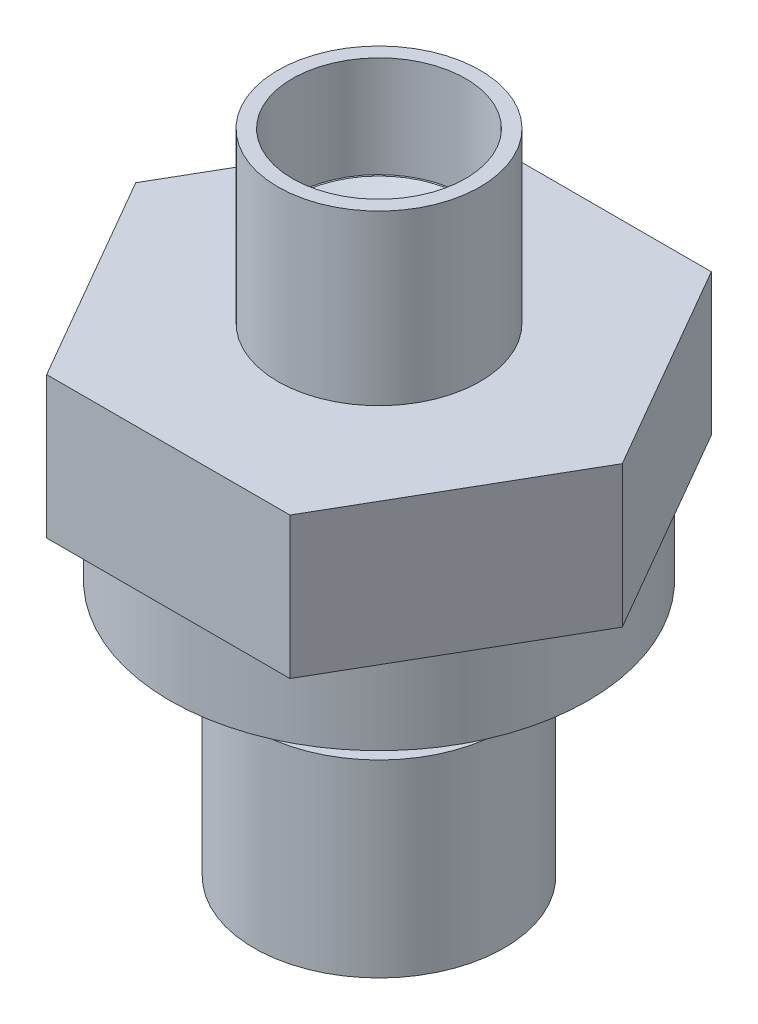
ISO-10303-21;
HEADER;
FILE_DESCRIPTION(('STEP AP214'),'2;1');
FILE_NAME('part.step','',(''),(''),'','','');
FILE_SCHEMA(('AUTOMOTIVE_DESIGN { 1 0 10303 214 1 1 1 1 }'));
ENDSEC;
DATA;
#1=APPLICATION_CONTEXT('core data for automotive mechanical design processes');
#2=APPLICATION_PROTOCOL_DEFINITION('international standard','automotive_design',2000,#1);
#3=PRODUCT_CONTEXT('',#1,'mechanical');
#4=PRODUCT('Part','Part','',(#3));
#5=PRODUCT_RELATED_PRODUCT_CATEGORY('part','',(#4));
#6=PRODUCT_DEFINITION_FORMATION('','',#4);
#7=PRODUCT_DEFINITION_CONTEXT('part definition',#1,'design');
#8=PRODUCT_DEFINITION('design','',#6,#7);
#9=PRODUCT_DEFINITION_SHAPE('','',#8);
#10=(LENGTH_UNIT() NAMED_UNIT(*) SI_UNIT(.MILLI.,.METRE.));
#11=(NAMED_UNIT(*) PLANE_ANGLE_UNIT() SI_UNIT($,.RADIAN.));
#12=(NAMED_UNIT(*) SI_UNIT($,.STERADIAN.) SOLID_ANGLE_UNIT());
#13=UNCERTAINTY_MEASURE_WITH_UNIT(LENGTH_MEASURE(1.E-05),#10,'distance_accuracy_value','');
#14=(GEOMETRIC_REPRESENTATION_CONTEXT(3) GLOBAL_UNCERTAINTY_ASSIGNED_CONTEXT((#13)) GLOBAL_UNIT_ASSIGNED_CONTEXT((#10,
#11,#12)) REPRESENTATION_CONTEXT('',''));
#15=CARTESIAN_POINT('',(0.,0.,0.));
#16=DIRECTION('',(0.,0.,1.));
#17=DIRECTION('',(1.,0.,0.));
#18=AXIS2_PLACEMENT_3D('',#15,#16,#17);
#19=CARTESIAN_POINT('',(0.,-12.7,0.));
#20=DIRECTION('',(0.,1.,0.));
#21=DIRECTION('',(0.,0.,1.));
#22=AXIS2_PLACEMENT_3D('',#19,#20,#21);
#23=CYLINDRICAL_SURFACE('',#22,1.524);
#24=CARTESIAN_POINT('',(0.,7.26439999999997,1.11022302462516E-13));
#25=DIRECTION('',(0.,1.,0.));
#26=DIRECTION('',(0.,0.,1.));
#27=AXIS2_PLACEMENT_3D('',#24,#25,#26);
#28=CIRCLE('',#27,1.524);
#29=CARTESIAN_POINT('',(0.,7.26439999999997,1.524));
#30=VERTEX_POINT('',#29);
#31=EDGE_CURVE('E12',#30,#30,#28,.T.);
#32=CARTESIAN_POINT('',(0.,4.41959999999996,1.11022302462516E-13));
#33=DIRECTION('',(0.,-1.,0.));
#34=DIRECTION('',(0.,0.,-1.));
#35=AXIS2_PLACEMENT_3D('',#32,#33,#34);
#36=CIRCLE('',#35,1.524);
#37=CARTESIAN_POINT('',(0.,4.41959999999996,1.524));
#38=VERTEX_POINT('',#37);
#39=EDGE_CURVE('E225',#38,#38,#36,.T.);
#40=CARTESIAN_POINT('',(0.,7.26439999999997,1.524));
#41=CARTESIAN_POINT('',(0.,7.23476666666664,1.524));
#42=CARTESIAN_POINT('',(0.,7.2051333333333,1.524));
#43=CARTESIAN_POINT('',(0.,7.14586666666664,1.524));
#44=CARTESIAN_POINT('',(0.,7.1162333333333,1.524));
#45=CARTESIAN_POINT('',(0.,7.05696666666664,1.524));
#46=CARTESIAN_POINT('',(0.,7.0273333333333,1.524));
#47=CARTESIAN_POINT('',(0.,6.96806666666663,1.524));
#48=CARTESIAN_POINT('',(0.,6.9384333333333,1.524));
#49=CARTESIAN_POINT('',(0.,6.87916666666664,1.524));
#50=CARTESIAN_POINT('',(0.,6.8495333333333,1.524));
#51=CARTESIAN_POINT('',(0.,6.79026666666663,1.524));
#52=CARTESIAN_POINT('',(0.,6.7606333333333,1.524));
#53=CARTESIAN_POINT('',(0.,6.70136666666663,1.524));
#54=CARTESIAN_POINT('',(0.,6.6717333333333,1.524));
#55=CARTESIAN_POINT('',(0.,6.61246666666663,1.524));
#56=CARTESIAN_POINT('',(0.,6.5828333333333,1.524));
#57=CARTESIAN_POINT('',(0.,6.52356666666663,1.524));
#58=CARTESIAN_POINT('',(0.,6.4939333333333,1.524));
#59=CARTESIAN_POINT('',(0.,6.43466666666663,1.524));
#60=CARTESIAN_POINT('',(0.,6.4050333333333,1.524));
#61=CARTESIAN_POINT('',(0.,6.34576666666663,1.524));
#62=CARTESIAN_POINT('',(0.,6.3161333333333,1.524));
#63=CARTESIAN_POINT('',(0.,6.25686666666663,1.524));
#64=CARTESIAN_POINT('',(0.,6.2272333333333,1.524));
#65=CARTESIAN_POINT('',(0.,6.16796666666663,1.524));
#66=CARTESIAN_POINT('',(0.,6.1383333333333,1.524));
#67=CARTESIAN_POINT('',(0.,6.07906666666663,1.524));
#68=CARTESIAN_POINT('',(0.,6.0494333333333,1.524));
#69=CARTESIAN_POINT('',(0.,5.99016666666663,1.524));
#70=CARTESIAN_POINT('',(0.,5.9605333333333,1.524));
#71=CARTESIAN_POINT('',(0.,5.90126666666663,1.524));
#72=CARTESIAN_POINT('',(0.,5.8716333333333,1.524));
#73=CARTESIAN_POINT('',(0.,5.81236666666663,1.524));
#74=CARTESIAN_POINT('',(0.,5.7827333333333,1.524));
#75=CARTESIAN_POINT('',(0.,5.72346666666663,1.524));
#76=CARTESIAN_POINT('',(0.,5.6938333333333,1.524));
#77=CARTESIAN_POINT('',(0.,5.63456666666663,1.524));
#78=CARTESIAN_POINT('',(0.,5.6049333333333,1.524));
#79=CARTESIAN_POINT('',(0.,5.54566666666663,1.524));
#80=CARTESIAN_POINT('',(0.,5.5160333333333,1.524));
#81=CARTESIAN_POINT('',(0.,5.45676666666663,1.524));
#82=CARTESIAN_POINT('',(0.,5.4271333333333,1.524));
#83=CARTESIAN_POINT('',(0.,5.36786666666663,1.524));
#84=CARTESIAN_POINT('',(0.,5.3382333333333,1.524));
#85=CARTESIAN_POINT('',(0.,5.27896666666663,1.524));
#86=CARTESIAN_POINT('',(0.,5.2493333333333,1.524));
#87=CARTESIAN_POINT('',(0.,5.19006666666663,1.524));
#88=CARTESIAN_POINT('',(0.,5.1604333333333,1.524));
#89=CARTESIAN_POINT('',(0.,5.10116666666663,1.524));
#90=CARTESIAN_POINT('',(0.,5.0715333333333,1.524));
#91=CARTESIAN_POINT('',(0.,5.01226666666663,1.524));
#92=CARTESIAN_POINT('',(0.,4.9826333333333,1.524));
#93=CARTESIAN_POINT('',(0.,4.92336666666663,1.524));
#94=CARTESIAN_POINT('',(0.,4.8937333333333,1.524));
#95=CARTESIAN_POINT('',(0.,4.83446666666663,1.524));
#96=CARTESIAN_POINT('',(0.,4.8048333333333,1.524));
#97=CARTESIAN_POINT('',(0.,4.74556666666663,1.524));
#98=CARTESIAN_POINT('',(0.,4.7159333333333,1.524));
#99=CARTESIAN_POINT('',(0.,4.65666666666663,1.524));
#100=CARTESIAN_POINT('',(0.,4.62703333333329,1.524));
#101=CARTESIAN_POINT('',(0.,4.56776666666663,1.524));
#102=CARTESIAN_POINT('',(0.,4.53813333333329,1.524));
#103=CARTESIAN_POINT('',(0.,4.47886666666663,1.524));
#104=CARTESIAN_POINT('',(0.,4.44923333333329,1.524));
#105=CARTESIAN_POINT('',(0.,4.41959999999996,1.524));
#106=B_SPLINE_CURVE_WITH_KNOTS('',3,(#40,#41,#42,#43,#44,#45,#46,#47,#48,#49,#50,#51,#52,#53,
#54,#55,#56,#57,#58,#59,#60,#61,#62,#63,#64,#65,#66,#67,#68,#69,#70,#71,#72,#73,#74,#75,#76,#77,
#78,#79,#80,#81,#82,#83,#84,#85,#86,#87,#88,#89,#90,#91,#92,#93,#94,#95,#96,#97,#98,#99,#100,
#101,#102,#103,#104,#105),.UNSPECIFIED.,.F.,.F.,(4,2,2,2,2,2,2,2,2,2,2,2,2,2,2,2,2,2,2,2,2,2,2,
2,2,2,2,2,2,2,2,2,4),(0.,0.0888999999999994,0.177799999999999,0.266700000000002,
0.355600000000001,0.4445,0.533400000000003,0.622300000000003,0.711200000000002,
0.800100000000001,0.889000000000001,0.977900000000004,1.0668,1.1557,1.24460000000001,1.3335,
1.4224,1.5113,1.6002,1.68910000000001,1.77800000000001,1.8669,1.95580000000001,2.04470000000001,
2.13360000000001,2.22250000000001,2.31140000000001,2.40030000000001,2.48920000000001,
2.57810000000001,2.66700000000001,2.75590000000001,2.84480000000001),.UNSPECIFIED.);
#107=EDGE_CURVE('BSEAM144',#30,#38,#106,.T.);
#108=ORIENTED_EDGE('',*,*,#31,.T.);
#109=ORIENTED_EDGE('',*,*,#39,.T.);
#110=ORIENTED_EDGE('',*,*,#107,.T.);
#111=ORIENTED_EDGE('',*,*,#107,.F.);
#112=EDGE_LOOP('',(#108,#110,#109,#111));
#113=FACE_BOUND('',#112,.T.);
#114=ADVANCED_FACE('F144',(#113),#23,.F.);
#115=CARTESIAN_POINT('',(9.16543552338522,5.33399999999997,1.52655665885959E-13));
#116=DIRECTION('',(0.,1.,0.));
#117=DIRECTION('',(0.,0.,1.));
#118=AXIS2_PLACEMENT_3D('',#115,#116,#117);
#119=PLANE('',#118);
#120=DIRECTION('',(-0.499999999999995,0.,-0.866025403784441));
#121=VECTOR('',#120,1.);
#122=CARTESIAN_POINT('',(6.87407664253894,5.33399999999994,-3.96874999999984));
#123=LINE('',#122,#121);
#124=CARTESIAN_POINT('',(9.16543552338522,5.33399999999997,1.11022302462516E-13));
#125=VERTEX_POINT('',#124);
#126=CARTESIAN_POINT('',(4.5827177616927,5.33399999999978,-7.93749999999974));
#127=VERTEX_POINT('',#126);
#128=EDGE_CURVE('E217',#125,#127,#123,.T.);
#129=ORIENTED_EDGE('',*,*,#128,.T.);
#130=DIRECTION('',(-1.,0.,0.));
#131=VECTOR('',#130,1.);
#132=CARTESIAN_POINT('',(0.,5.33399999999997,-7.93749999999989));
#133=LINE('',#132,#131);
#134=CARTESIAN_POINT('',(-4.58271776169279,5.334,-7.93749999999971));
#135=VERTEX_POINT('',#134);
#136=EDGE_CURVE('E220',#127,#135,#133,.T.);
#137=ORIENTED_EDGE('',*,*,#136,.T.);
#138=DIRECTION('',(-0.499999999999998,0.,0.86602540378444));
#139=VECTOR('',#138,1.);
#140=CARTESIAN_POINT('',(-6.874076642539,5.33399999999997,-3.96874999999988));
#141=LINE('',#140,#139);
#142=CARTESIAN_POINT('',(-9.16543552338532,5.33399999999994,1.11022302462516E-13));
#143=VERTEX_POINT('',#142);
#144=EDGE_CURVE('E349',#135,#143,#141,.T.);
#145=ORIENTED_EDGE('',*,*,#144,.T.);
#146=DIRECTION('',(0.499999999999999,0.,0.866025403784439));
#147=VECTOR('',#146,1.);
#148=CARTESIAN_POINT('',(-6.874076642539,5.33399999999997,3.9687500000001));
#149=LINE('',#148,#147);
#150=CARTESIAN_POINT('',(-4.58271776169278,5.334,7.9374999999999));
#151=VERTEX_POINT('',#150);
#152=EDGE_CURVE('E338',#143,#151,#149,.T.);
#153=ORIENTED_EDGE('',*,*,#152,.T.);
#154=DIRECTION('',(1.,0.,0.));
#155=VECTOR('',#154,1.);
#156=CARTESIAN_POINT('',(0.,5.33399999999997,7.93750000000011));
#157=LINE('',#156,#155);
#158=CARTESIAN_POINT('',(4.5827177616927,5.33399999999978,7.93749999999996));
#159=VERTEX_POINT('',#158);
#160=EDGE_CURVE('E164',#151,#159,#157,.T.);
#161=ORIENTED_EDGE('',*,*,#160,.T.);
#162=DIRECTION('',(0.499999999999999,0.,-0.866025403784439));
#163=VECTOR('',#162,1.);
#164=CARTESIAN_POINT('',(6.87407664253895,5.33399999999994,3.96875000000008));
#165=LINE('',#164,#163);
#166=EDGE_CURVE('E159',#159,#125,#165,.T.);
#167=ORIENTED_EDGE('',*,*,#166,.T.);
#168=EDGE_LOOP('',(#129,#137,#145,#153,#161,#167));
#169=FACE_BOUND('',#168,.T.);
#170=CARTESIAN_POINT('',(0.,5.33399999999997,1.11022302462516E-13));
#171=DIRECTION('',(0.,1.,0.));
#172=DIRECTION('',(0.,0.,1.));
#173=AXIS2_PLACEMENT_3D('',#170,#171,#172);
#174=CIRCLE('',#173,3.81);
#175=CARTESIAN_POINT('',(0.,5.33399999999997,3.81000000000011));
#176=VERTEX_POINT('',#175);
#177=EDGE_CURVE('E387',#176,#176,#174,.T.);
#178=ORIENTED_EDGE('',*,*,#177,.F.);
#179=EDGE_LOOP('',(#178));
#180=FACE_BOUND('',#179,.T.);
#181=ADVANCED_FACE('F251',(#169,#180),#119,.T.);
#182=CARTESIAN_POINT('',(0.,-3.04800000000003,0.));
#183=DIRECTION('',(0.,-1.,0.));
#184=DIRECTION('',(0.,0.,-1.));
#185=AXIS2_PLACEMENT_3D('',#182,#183,#184);
#186=PLANE('',#185);
#187=CARTESIAN_POINT('',(0.,-3.04800000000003,0.));
#188=DIRECTION('',(0.,-1.,0.));
#189=DIRECTION('',(0.,0.,-1.));
#190=AXIS2_PLACEMENT_3D('',#187,#188,#189);
#191=CIRCLE('',#190,4.826);
#192=CARTESIAN_POINT('',(0.,-3.04800000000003,-4.826));
#193=VERTEX_POINT('',#192);
#194=EDGE_CURVE('E369',#193,#193,#191,.T.);
#195=ORIENTED_EDGE('',*,*,#194,.T.);
#196=EDGE_LOOP('',(#195));
#197=FACE_BOUND('',#196,.T.);
#198=CARTESIAN_POINT('',(0.,-3.04800000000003,0.));
#199=DIRECTION('',(0.,-1.,0.));
#200=DIRECTION('',(0.,0.,-1.));
#201=AXIS2_PLACEMENT_3D('',#198,#199,#200);
#202=CIRCLE('',#201,3.9751);
#203=CARTESIAN_POINT('',(0.,-3.04800000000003,-3.9751));
#204=VERTEX_POINT('',#203);
#205=EDGE_CURVE('E375',#204,#204,#202,.T.);
#206=ORIENTED_EDGE('',*,*,#205,.F.);
#207=EDGE_LOOP('',(#206));
#208=FACE_BOUND('',#207,.T.);
#209=ADVANCED_FACE('F257',(#197,#208),#186,.T.);
#210=CARTESIAN_POINT('',(9.16543552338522,0.,0.));
#211=DIRECTION('',(0.,1.,0.));
#212=DIRECTION('',(0.,0.,1.));
#213=AXIS2_PLACEMENT_3D('',#210,#211,#212);
#214=PLANE('',#213);
#215=DIRECTION('',(-1.,0.,0.));
#216=VECTOR('',#215,1.);
#217=CARTESIAN_POINT('',(0.,0.,-7.9375));
#218=LINE('',#217,#216);
#219=CARTESIAN_POINT('',(4.5827177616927,-2.28983498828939E-13,-7.93749999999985));
#220=VERTEX_POINT('',#219);
#221=CARTESIAN_POINT('',(-4.58271776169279,0.,-7.93749999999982));
#222=VERTEX_POINT('',#221);
#223=EDGE_CURVE('E197',#220,#222,#218,.T.);
#224=ORIENTED_EDGE('',*,*,#223,.F.);
#225=DIRECTION('',(-0.499999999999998,0.,-0.86602540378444));
#226=VECTOR('',#225,1.);
#227=CARTESIAN_POINT('',(6.87407664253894,0.,-3.96874999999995));
#228=LINE('',#227,#226);
#229=CARTESIAN_POINT('',(9.16543552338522,0.,0.));
#230=VERTEX_POINT('',#229);
#231=EDGE_CURVE('E201',#230,#220,#228,.T.);
#232=ORIENTED_EDGE('',*,*,#231,.F.);
#233=DIRECTION('',(0.499999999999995,0.,-0.866025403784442));
#234=VECTOR('',#233,1.);
#235=CARTESIAN_POINT('',(6.87407664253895,0.,3.96874999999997));
#236=LINE('',#235,#234);
#237=CARTESIAN_POINT('',(4.58271776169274,-2.28983498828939E-13,7.93749999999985));
#238=VERTEX_POINT('',#237);
#239=EDGE_CURVE('E218',#238,#230,#236,.T.);
#240=ORIENTED_EDGE('',*,*,#239,.F.);
#241=DIRECTION('',(1.,0.,0.));
#242=VECTOR('',#241,1.);
#243=CARTESIAN_POINT('',(0.,0.,7.9375));
#244=LINE('',#243,#242);
#245=CARTESIAN_POINT('',(-4.58271776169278,0.,7.93749999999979));
#246=VERTEX_POINT('',#245);
#247=EDGE_CURVE('E354',#246,#238,#244,.T.);
#248=ORIENTED_EDGE('',*,*,#247,.F.);
#249=DIRECTION('',(0.500000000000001,0.,0.866025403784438));
#250=VECTOR('',#249,1.);
#251=CARTESIAN_POINT('',(-6.87407664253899,0.,3.96874999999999));
#252=LINE('',#251,#250);
#253=CARTESIAN_POINT('',(-9.1654355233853,0.,0.));
#254=VERTEX_POINT('',#253);
#255=EDGE_CURVE('E333',#254,#246,#252,.T.);
#256=ORIENTED_EDGE('',*,*,#255,.F.);
#257=DIRECTION('',(-0.499999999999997,0.,0.86602540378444));
#258=VECTOR('',#257,1.);
#259=CARTESIAN_POINT('',(-6.87407664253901,0.,-3.96874999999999));
#260=LINE('',#259,#258);
#261=EDGE_CURVE('E203',#222,#254,#260,.T.);
#262=ORIENTED_EDGE('',*,*,#261,.F.);
#263=EDGE_LOOP('',(#224,#232,#240,#248,#256,#262));
#264=FACE_BOUND('',#263,.T.);
#265=CARTESIAN_POINT('',(0.,0.,0.));
#266=DIRECTION('',(0.,1.,0.));
#267=DIRECTION('',(0.,0.,1.));
#268=AXIS2_PLACEMENT_3D('',#265,#266,#267);
#269=CIRCLE('',#268,7.874);
#270=CARTESIAN_POINT('',(0.,0.,7.874));
#271=VERTEX_POINT('',#270);
#272=EDGE_CURVE('E221',#271,#271,#269,.F.);
#273=ORIENTED_EDGE('',*,*,#272,.F.);
#274=EDGE_LOOP('',(#273));
#275=FACE_BOUND('',#274,.T.);
#276=ADVANCED_FACE('F199',(#264,#275),#214,.F.);
#277=CARTESIAN_POINT('',(0.,5.33399999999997,-7.93749999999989));
#278=DIRECTION('',(0.,0.,1.));
#279=DIRECTION('',(1.,0.,0.));
#280=AXIS2_PLACEMENT_3D('',#277,#278,#279);
#281=PLANE('',#280);
#282=ORIENTED_EDGE('',*,*,#223,.T.);
#283=DIRECTION('',(0.,-1.,0.));
#284=VECTOR('',#283,1.);
#285=CARTESIAN_POINT('',(-4.58271776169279,5.334,-7.93749999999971));
#286=LINE('',#285,#284);
#287=EDGE_CURVE('E222',#135,#222,#286,.T.);
#288=ORIENTED_EDGE('',*,*,#287,.F.);
#289=ORIENTED_EDGE('',*,*,#136,.F.);
#290=DIRECTION('',(0.,-1.,0.));
#291=VECTOR('',#290,1.);
#292=CARTESIAN_POINT('',(4.5827177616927,5.33399999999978,-7.93749999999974));
#293=LINE('',#292,#291);
#294=EDGE_CURVE('E214',#127,#220,#293,.T.);
#295=ORIENTED_EDGE('',*,*,#294,.T.);
#296=EDGE_LOOP('',(#282,#288,#289,#295));
#297=FACE_BOUND('',#296,.T.);
#298=ADVANCED_FACE('F146',(#297),#281,.F.);
#299=CARTESIAN_POINT('',(-6.874076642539,5.33399999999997,-3.96874999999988));
#300=DIRECTION('',(0.866025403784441,0.,0.499999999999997));
#301=DIRECTION('',(0.499999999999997,0.,-0.866025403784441));
#302=AXIS2_PLACEMENT_3D('',#299,#300,#301);
#303=PLANE('',#302);
#304=ORIENTED_EDGE('',*,*,#261,.T.);
#305=DIRECTION('',(0.,-1.,0.));
#306=VECTOR('',#305,1.);
#307=CARTESIAN_POINT('',(-9.16543552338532,5.33399999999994,1.11022302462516E-13));
#308=LINE('',#307,#306);
#309=EDGE_CURVE('E227',#143,#254,#308,.T.);
#310=ORIENTED_EDGE('',*,*,#309,.F.);
#311=ORIENTED_EDGE('',*,*,#144,.F.);
#312=ORIENTED_EDGE('',*,*,#287,.T.);
#313=EDGE_LOOP('',(#304,#310,#311,#312));
#314=FACE_BOUND('',#313,.T.);
#315=ADVANCED_FACE('F322',(#314),#303,.F.);
#316=CARTESIAN_POINT('',(-6.874076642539,5.33399999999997,3.9687500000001));
#317=DIRECTION('',(0.866025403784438,0.,-0.500000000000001));
#318=DIRECTION('',(-0.500000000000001,0.,-0.866025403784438));
#319=AXIS2_PLACEMENT_3D('',#316,#317,#318);
#320=PLANE('',#319);
#321=ORIENTED_EDGE('',*,*,#255,.T.);
#322=DIRECTION('',(0.,-1.,0.));
#323=VECTOR('',#322,1.);
#324=CARTESIAN_POINT('',(-4.58271776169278,5.334,7.9374999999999));
#325=LINE('',#324,#323);
#326=EDGE_CURVE('E339',#151,#246,#325,.T.);
#327=ORIENTED_EDGE('',*,*,#326,.F.);
#328=ORIENTED_EDGE('',*,*,#152,.F.);
#329=ORIENTED_EDGE('',*,*,#309,.T.);
#330=EDGE_LOOP('',(#321,#327,#328,#329));
#331=FACE_BOUND('',#330,.T.);
#332=ADVANCED_FACE('F319',(#331),#320,.F.);
#333=CARTESIAN_POINT('',(0.,5.33399999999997,7.93750000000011));
#334=DIRECTION('',(0.,0.,-1.));
#335=DIRECTION('',(-1.,0.,0.));
#336=AXIS2_PLACEMENT_3D('',#333,#334,#335);
#337=PLANE('',#336);
#338=ORIENTED_EDGE('',*,*,#247,.T.);
#339=DIRECTION('',(0.,-1.,0.));
#340=VECTOR('',#339,1.);
#341=CARTESIAN_POINT('',(4.5827177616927,5.33399999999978,7.93749999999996));
#342=LINE('',#341,#340);
#343=EDGE_CURVE('E340',#159,#238,#342,.T.);
#344=ORIENTED_EDGE('',*,*,#343,.F.);
#345=ORIENTED_EDGE('',*,*,#160,.F.);
#346=ORIENTED_EDGE('',*,*,#326,.T.);
#347=EDGE_LOOP('',(#338,#344,#345,#346));
#348=FACE_BOUND('',#347,.T.);
#349=ADVANCED_FACE('F315',(#348),#337,.F.);
#350=CARTESIAN_POINT('',(6.87407664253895,5.33399999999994,3.96875000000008));
#351=DIRECTION('',(-0.866025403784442,0.,-0.499999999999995));
#352=DIRECTION('',(-0.499999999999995,0.,0.866025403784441));
#353=AXIS2_PLACEMENT_3D('',#350,#351,#352);
#354=PLANE('',#353);
#355=ORIENTED_EDGE('',*,*,#239,.T.);
#356=DIRECTION('',(0.,-1.,0.));
#357=VECTOR('',#356,1.);
#358=CARTESIAN_POINT('',(9.16543552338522,5.33399999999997,1.11022302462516E-13));
#359=LINE('',#358,#357);
#360=EDGE_CURVE('E216',#125,#230,#359,.T.);
#361=ORIENTED_EDGE('',*,*,#360,.F.);
#362=ORIENTED_EDGE('',*,*,#166,.F.);
#363=ORIENTED_EDGE('',*,*,#343,.T.);
#364=EDGE_LOOP('',(#355,#361,#362,#363));
#365=FACE_BOUND('',#364,.T.);
#366=ADVANCED_FACE('F312',(#365),#354,.F.);
#367=CARTESIAN_POINT('',(6.87407664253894,5.33399999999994,-3.96874999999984));
#368=DIRECTION('',(-0.86602540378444,0.,0.499999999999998));
#369=DIRECTION('',(0.499999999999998,0.,0.86602540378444));
#370=AXIS2_PLACEMENT_3D('',#367,#368,#369);
#371=PLANE('',#370);
#372=ORIENTED_EDGE('',*,*,#231,.T.);
#373=ORIENTED_EDGE('',*,*,#294,.F.);
#374=ORIENTED_EDGE('',*,*,#128,.F.);
#375=ORIENTED_EDGE('',*,*,#360,.T.);
#376=EDGE_LOOP('',(#372,#373,#374,#375));
#377=FACE_BOUND('',#376,.T.);
#378=ADVANCED_FACE('F213',(#377),#371,.F.);
#379=CARTESIAN_POINT('',(0.,-3.04800000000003,0.));
#380=DIRECTION('',(0.,1.,0.));
#381=DIRECTION('',(0.,0.,1.));
#382=AXIS2_PLACEMENT_3D('',#379,#380,#381);
#383=CYLINDRICAL_SURFACE('',#382,7.874);
#384=CARTESIAN_POINT('',(0.,-3.04800000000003,0.));
#385=DIRECTION('',(0.,-1.,0.));
#386=DIRECTION('',(0.,0.,-1.));
#387=AXIS2_PLACEMENT_3D('',#384,#385,#386);
#388=CIRCLE('',#387,7.874);
#389=CARTESIAN_POINT('',(0.,-3.04800000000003,7.874));
#390=VERTEX_POINT('',#389);
#391=EDGE_CURVE('E208',#390,#390,#388,.T.);
#392=CARTESIAN_POINT('',(0.,-3.04800000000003,7.874));
#393=CARTESIAN_POINT('',(0.,-3.01625000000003,7.874));
#394=CARTESIAN_POINT('',(0.,-2.98450000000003,7.874));
#395=CARTESIAN_POINT('',(0.,-2.92100000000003,7.874));
#396=CARTESIAN_POINT('',(0.,-2.88925000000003,7.874));
#397=CARTESIAN_POINT('',(0.,-2.82575000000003,7.874));
#398=CARTESIAN_POINT('',(0.,-2.79400000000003,7.874));
#399=CARTESIAN_POINT('',(0.,-2.73050000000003,7.874));
#400=CARTESIAN_POINT('',(0.,-2.69875000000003,7.874));
#401=CARTESIAN_POINT('',(0.,-2.63525000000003,7.874));
#402=CARTESIAN_POINT('',(0.,-2.60350000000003,7.874));
#403=CARTESIAN_POINT('',(0.,-2.54000000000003,7.874));
#404=CARTESIAN_POINT('',(0.,-2.50825000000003,7.874));
#405=CARTESIAN_POINT('',(0.,-2.44475000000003,7.874));
#406=CARTESIAN_POINT('',(0.,-2.41300000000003,7.874));
#407=CARTESIAN_POINT('',(0.,-2.34950000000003,7.874));
#408=CARTESIAN_POINT('',(0.,-2.31775000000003,7.874));
#409=CARTESIAN_POINT('',(0.,-2.25425000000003,7.874));
#410=CARTESIAN_POINT('',(0.,-2.22250000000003,7.874));
#411=CARTESIAN_POINT('',(0.,-2.15900000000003,7.874));
#412=CARTESIAN_POINT('',(0.,-2.12725000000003,7.874));
#413=CARTESIAN_POINT('',(0.,-2.06375000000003,7.874));
#414=CARTESIAN_POINT('',(0.,-2.03200000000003,7.874));
#415=CARTESIAN_POINT('',(0.,-1.96850000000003,7.874));
#416=CARTESIAN_POINT('',(0.,-1.93675000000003,7.874));
#417=CARTESIAN_POINT('',(0.,-1.87325000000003,7.874));
#418=CARTESIAN_POINT('',(0.,-1.84150000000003,7.874));
#419=CARTESIAN_POINT('',(0.,-1.77800000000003,7.874));
#420=CARTESIAN_POINT('',(0.,-1.74625000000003,7.874));
#421=CARTESIAN_POINT('',(0.,-1.68275000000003,7.874));
#422=CARTESIAN_POINT('',(0.,-1.65100000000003,7.874));
#423=CARTESIAN_POINT('',(0.,-1.58750000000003,7.874));
#424=CARTESIAN_POINT('',(0.,-1.55575000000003,7.874));
#425=CARTESIAN_POINT('',(0.,-1.49225000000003,7.874));
#426=CARTESIAN_POINT('',(0.,-1.46050000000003,7.874));
#427=CARTESIAN_POINT('',(0.,-1.39700000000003,7.874));
#428=CARTESIAN_POINT('',(0.,-1.36525000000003,7.874));
#429=CARTESIAN_POINT('',(0.,-1.30175000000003,7.874));
#430=CARTESIAN_POINT('',(0.,-1.27000000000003,7.874));
#431=CARTESIAN_POINT('',(0.,-1.20650000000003,7.874));
#432=CARTESIAN_POINT('',(0.,-1.17475000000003,7.874));
#433=CARTESIAN_POINT('',(0.,-1.11125000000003,7.874));
#434=CARTESIAN_POINT('',(0.,-1.07950000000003,7.874));
#435=CARTESIAN_POINT('',(0.,-1.01600000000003,7.874));
#436=CARTESIAN_POINT('',(0.,-0.984250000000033,7.874));
#437=CARTESIAN_POINT('',(0.,-0.920750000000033,7.874));
#438=CARTESIAN_POINT('',(0.,-0.889000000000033,7.874));
#439=CARTESIAN_POINT('',(0.,-0.825500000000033,7.874));
#440=CARTESIAN_POINT('',(0.,-0.793750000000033,7.874));
#441=CARTESIAN_POINT('',(0.,-0.730250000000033,7.874));
#442=CARTESIAN_POINT('',(0.,-0.698500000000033,7.874));
#443=CARTESIAN_POINT('',(0.,-0.635000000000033,7.874));
#444=CARTESIAN_POINT('',(0.,-0.603250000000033,7.874));
#445=CARTESIAN_POINT('',(0.,-0.539750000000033,7.874));
#446=CARTESIAN_POINT('',(0.,-0.508000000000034,7.874));
#447=CARTESIAN_POINT('',(0.,-0.444500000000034,7.874));
#448=CARTESIAN_POINT('',(0.,-0.412750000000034,7.874));
#449=CARTESIAN_POINT('',(0.,-0.349250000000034,7.874));
#450=CARTESIAN_POINT('',(0.,-0.317500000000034,7.874));
#451=CARTESIAN_POINT('',(0.,-0.254000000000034,7.874));
#452=CARTESIAN_POINT('',(0.,-0.222250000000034,7.874));
#453=CARTESIAN_POINT('',(0.,-0.158750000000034,7.874));
#454=CARTESIAN_POINT('',(0.,-0.127000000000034,7.874));
#455=CARTESIAN_POINT('',(0.,-0.0635000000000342,7.874));
#456=CARTESIAN_POINT('',(0.,-0.0317500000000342,7.874));
#457=CARTESIAN_POINT('',(0.,0.,7.874));
#458=B_SPLINE_CURVE_WITH_KNOTS('',3,(#392,#393,#394,#395,#396,#397,#398,#399,#400,#401,#402,
#403,#404,#405,#406,#407,#408,#409,#410,#411,#412,#413,#414,#415,#416,#417,#418,#419,#420,#421,
#422,#423,#424,#425,#426,#427,#428,#429,#430,#431,#432,#433,#434,#435,#436,#437,#438,#439,#440,
#441,#442,#443,#444,#445,#446,#447,#448,#449,#450,#451,#452,#453,#454,#455,#456,#457),
.UNSPECIFIED.,.F.,.F.,(4,2,2,2,2,2,2,2,2,2,2,2,2,2,2,2,2,2,2,2,2,2,2,2,2,2,2,2,2,2,2,2,4),(0.,
0.0952499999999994,0.190499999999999,0.285749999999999,0.380999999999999,0.476249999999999,
0.571499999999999,0.666749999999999,0.761999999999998,0.857249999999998,0.952499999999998,
1.04775,1.143,1.23825,1.3335,1.42875,1.524,1.61925,1.7145,1.80975,1.905,2.00025,2.0955,2.19075,
2.286,2.38125,2.4765,2.57175,2.667,2.76225,2.8575,2.95275,3.048),.UNSPECIFIED.);
#459=EDGE_CURVE('BSEAM303',#390,#271,#458,.T.);
#460=ORIENTED_EDGE('',*,*,#391,.F.);
#461=ORIENTED_EDGE('',*,*,#272,.T.);
#462=ORIENTED_EDGE('',*,*,#459,.T.);
#463=ORIENTED_EDGE('',*,*,#459,.F.);
#464=EDGE_LOOP('',(#460,#462,#461,#463));
#465=FACE_BOUND('',#464,.T.);
#466=ADVANCED_FACE('F303',(#465),#383,.T.);
#467=CARTESIAN_POINT('',(0.,-3.04800000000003,0.));
#468=DIRECTION('',(0.,-1.,0.));
#469=DIRECTION('',(0.,0.,-1.));
#470=AXIS2_PLACEMENT_3D('',#467,#468,#469);
#471=CIRCLE('',#470,6.985);
#472=CARTESIAN_POINT('',(0.,-3.04800000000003,-6.985));
#473=VERTEX_POINT('',#472);
#474=EDGE_CURVE('E363',#473,#473,#471,.T.);
#475=ORIENTED_EDGE('',*,*,#474,.F.);
#476=EDGE_LOOP('',(#475));
#477=FACE_BOUND('',#476,.T.);
#478=ORIENTED_EDGE('',*,*,#391,.T.);
#479=EDGE_LOOP('',(#478));
#480=FACE_BOUND('',#479,.T.);
#481=ADVANCED_FACE('F299',(#477,#480),#186,.T.);
#482=CARTESIAN_POINT('',(0.,-1.77800000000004,0.));
#483=DIRECTION('',(0.,-1.,0.));
#484=DIRECTION('',(0.,0.,-1.));
#485=AXIS2_PLACEMENT_3D('',#482,#483,#484);
#486=CYLINDRICAL_SURFACE('',#485,6.985);
#487=CARTESIAN_POINT('',(0.,-1.77800000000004,0.));
#488=DIRECTION('',(0.,-1.,0.));
#489=DIRECTION('',(0.,0.,-1.));
#490=AXIS2_PLACEMENT_3D('',#487,#488,#489);
#491=CIRCLE('',#490,6.985);
#492=CARTESIAN_POINT('',(0.,-1.77800000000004,-6.985));
#493=VERTEX_POINT('',#492);
#494=EDGE_CURVE('E360',#493,#493,#491,.T.);
#495=ORIENTED_EDGE('',*,*,#494,.F.);
#496=EDGE_LOOP('',(#495));
#497=FACE_BOUND('',#496,.T.);
#498=ORIENTED_EDGE('',*,*,#474,.T.);
#499=EDGE_LOOP('',(#498));
#500=FACE_BOUND('',#499,.T.);
#501=ADVANCED_FACE('F295',(#497,#500),#486,.F.);
#502=CARTESIAN_POINT('',(0.,-1.77800000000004,0.));
#503=DIRECTION('',(0.,-1.,0.));
#504=DIRECTION('',(0.,0.,-1.));
#505=AXIS2_PLACEMENT_3D('',#502,#503,#504);
#506=PLANE('',#505);
#507=CARTESIAN_POINT('',(0.,-1.77800000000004,0.));
#508=DIRECTION('',(0.,-1.,0.));
#509=DIRECTION('',(0.,0.,-1.));
#510=AXIS2_PLACEMENT_3D('',#507,#508,#509);
#511=CIRCLE('',#510,4.826);
#512=CARTESIAN_POINT('',(0.,-1.77800000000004,-4.826));
#513=VERTEX_POINT('',#512);
#514=EDGE_CURVE('E366',#513,#513,#511,.T.);
#515=ORIENTED_EDGE('',*,*,#514,.F.);
#516=EDGE_LOOP('',(#515));
#517=FACE_BOUND('',#516,.T.);
#518=ORIENTED_EDGE('',*,*,#494,.T.);
#519=EDGE_LOOP('',(#518));
#520=FACE_BOUND('',#519,.T.);
#521=ADVANCED_FACE('F291',(#517,#520),#506,.T.);
#522=CARTESIAN_POINT('',(0.,-1.77800000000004,0.));
#523=DIRECTION('',(0.,-1.,0.));
#524=DIRECTION('',(0.,0.,-1.));
#525=AXIS2_PLACEMENT_3D('',#522,#523,#524);
#526=CYLINDRICAL_SURFACE('',#525,4.826);
#527=ORIENTED_EDGE('',*,*,#514,.T.);
#528=EDGE_LOOP('',(#527));
#529=FACE_BOUND('',#528,.T.);
#530=ORIENTED_EDGE('',*,*,#194,.F.);
#531=EDGE_LOOP('',(#530));
#532=FACE_BOUND('',#531,.T.);
#533=ADVANCED_FACE('F287',(#529,#532),#526,.T.);
#534=CARTESIAN_POINT('',(0.,-5.58800000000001,0.));
#535=DIRECTION('',(0.,1.,0.));
#536=DIRECTION('',(0.,0.,1.));
#537=AXIS2_PLACEMENT_3D('',#534,#535,#536);
#538=CYLINDRICAL_SURFACE('',#537,3.9751);
#539=CARTESIAN_POINT('',(0.,-5.58800000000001,0.));
#540=DIRECTION('',(0.,-1.,0.));
#541=DIRECTION('',(0.,0.,-1.));
#542=AXIS2_PLACEMENT_3D('',#539,#540,#541);
#543=CIRCLE('',#542,3.9751);
#544=CARTESIAN_POINT('',(0.,-5.58800000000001,-3.9751));
#545=VERTEX_POINT('',#544);
#546=EDGE_CURVE('E372',#545,#545,#543,.T.);
#547=ORIENTED_EDGE('',*,*,#546,.F.);
#548=EDGE_LOOP('',(#547));
#549=FACE_BOUND('',#548,.T.);
#550=ORIENTED_EDGE('',*,*,#205,.T.);
#551=EDGE_LOOP('',(#550));
#552=FACE_BOUND('',#551,.T.);
#553=ADVANCED_FACE('F277',(#549,#552),#538,.T.);
#554=CARTESIAN_POINT('',(0.,-5.58800000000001,0.));
#555=DIRECTION('',(0.,-1.,0.));
#556=DIRECTION('',(0.,0.,-1.));
#557=AXIS2_PLACEMENT_3D('',#554,#555,#556);
#558=PLANE('',#557);
#559=CARTESIAN_POINT('',(0.,-5.58800000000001,0.));
#560=DIRECTION('',(0.,-1.,0.));
#561=DIRECTION('',(0.,0.,-1.));
#562=AXIS2_PLACEMENT_3D('',#559,#560,#561);
#563=CIRCLE('',#562,4.7117);
#564=CARTESIAN_POINT('',(0.,-5.58800000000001,-4.7117));
#565=VERTEX_POINT('',#564);
#566=EDGE_CURVE('E381',#565,#565,#563,.T.);
#567=ORIENTED_EDGE('',*,*,#566,.F.);
#568=EDGE_LOOP('',(#567));
#569=FACE_BOUND('',#568,.T.);
#570=ORIENTED_EDGE('',*,*,#546,.T.);
#571=EDGE_LOOP('',(#570));
#572=FACE_BOUND('',#571,.T.);
#573=ADVANCED_FACE('F273',(#569,#572),#558,.F.);
#574=CARTESIAN_POINT('',(0.,-12.7,0.));
#575=DIRECTION('',(0.,1.,0.));
#576=DIRECTION('',(0.,0.,1.));
#577=AXIS2_PLACEMENT_3D('',#574,#575,#576);
#578=CYLINDRICAL_SURFACE('',#577,4.7117);
#579=CARTESIAN_POINT('',(0.,-12.7,0.));
#580=DIRECTION('',(0.,-1.,0.));
#581=DIRECTION('',(0.,0.,-1.));
#582=AXIS2_PLACEMENT_3D('',#579,#580,#581);
#583=CIRCLE('',#582,4.7117);
#584=CARTESIAN_POINT('',(0.,-12.7,-4.7117));
#585=VERTEX_POINT('',#584);
#586=EDGE_CURVE('E378',#585,#585,#583,.T.);
#587=ORIENTED_EDGE('',*,*,#586,.F.);
#588=EDGE_LOOP('',(#587));
#589=FACE_BOUND('',#588,.T.);
#590=ORIENTED_EDGE('',*,*,#566,.T.);
#591=EDGE_LOOP('',(#590));
#592=FACE_BOUND('',#591,.T.);
#593=ADVANCED_FACE('F276',(#589,#592),#578,.T.);
#594=CARTESIAN_POINT('',(0.,-12.7,0.));
#595=DIRECTION('',(0.,-1.,0.));
#596=DIRECTION('',(0.,0.,-1.));
#597=AXIS2_PLACEMENT_3D('',#594,#595,#596);
#598=PLANE('',#597);
#599=CARTESIAN_POINT('',(0.,-12.7,0.));
#600=DIRECTION('',(0.,-1.,0.));
#601=DIRECTION('',(0.,0.,-1.));
#602=AXIS2_PLACEMENT_3D('',#599,#600,#601);
#603=CIRCLE('',#602,2.3876);
#604=CARTESIAN_POINT('',(0.,-12.7,-2.3876));
#605=VERTEX_POINT('',#604);
#606=EDGE_CURVE('E399',#605,#605,#603,.T.);
#607=ORIENTED_EDGE('',*,*,#606,.F.);
#608=EDGE_LOOP('',(#607));
#609=FACE_BOUND('',#608,.T.);
#610=ORIENTED_EDGE('',*,*,#586,.T.);
#611=EDGE_LOOP('',(#610));
#612=FACE_BOUND('',#611,.T.);
#613=ADVANCED_FACE('F271',(#609,#612),#598,.T.);
#614=CARTESIAN_POINT('',(0.,11.684,1.11022302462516E-13));
#615=DIRECTION('',(0.,-1.,0.));
#616=DIRECTION('',(0.,0.,-1.));
#617=AXIS2_PLACEMENT_3D('',#614,#615,#616);
#618=CYLINDRICAL_SURFACE('',#617,3.81);
#619=CARTESIAN_POINT('',(0.,11.684,1.11022302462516E-13));
#620=DIRECTION('',(0.,1.,0.));
#621=DIRECTION('',(0.,0.,1.));
#622=AXIS2_PLACEMENT_3D('',#619,#620,#621);
#623=CIRCLE('',#622,3.81);
#624=CARTESIAN_POINT('',(0.,11.684,3.81000000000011));
#625=VERTEX_POINT('',#624);
#626=EDGE_CURVE('E384',#625,#625,#623,.T.);
#627=ORIENTED_EDGE('',*,*,#626,.F.);
#628=EDGE_LOOP('',(#627));
#629=FACE_BOUND('',#628,.T.);
#630=ORIENTED_EDGE('',*,*,#177,.T.);
#631=EDGE_LOOP('',(#630));
#632=FACE_BOUND('',#631,.T.);
#633=ADVANCED_FACE('F267',(#629,#632),#618,.T.);
#634=CARTESIAN_POINT('',(0.,11.684,1.11022302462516E-13));
#635=DIRECTION('',(0.,1.,0.));
#636=DIRECTION('',(0.,0.,1.));
#637=AXIS2_PLACEMENT_3D('',#634,#635,#636);
#638=PLANE('',#637);
#639=CARTESIAN_POINT('',(0.,11.684,1.11022302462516E-13));
#640=DIRECTION('',(0.,1.,0.));
#641=DIRECTION('',(0.,0.,1.));
#642=AXIS2_PLACEMENT_3D('',#639,#640,#641);
#643=CIRCLE('',#642,3.2639);
#644=CARTESIAN_POINT('',(0.,11.684,3.26390000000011));
#645=VERTEX_POINT('',#644);
#646=EDGE_CURVE('E393',#645,#645,#643,.T.);
#647=ORIENTED_EDGE('',*,*,#646,.F.);
#648=EDGE_LOOP('',(#647));
#649=FACE_BOUND('',#648,.T.);
#650=ORIENTED_EDGE('',*,*,#626,.T.);
#651=EDGE_LOOP('',(#650));
#652=FACE_BOUND('',#651,.T.);
#653=ADVANCED_FACE('F264',(#649,#652),#638,.T.);
#654=CARTESIAN_POINT('',(0.,7.87399999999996,1.11022302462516E-13));
#655=DIRECTION('',(0.,1.,0.));
#656=DIRECTION('',(0.,0.,1.));
#657=AXIS2_PLACEMENT_3D('',#654,#655,#656);
#658=PLANE('',#657);
#659=CARTESIAN_POINT('',(0.,7.87399999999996,1.11022302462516E-13));
#660=DIRECTION('',(0.,1.,0.));
#661=DIRECTION('',(0.,0.,1.));
#662=AXIS2_PLACEMENT_3D('',#659,#660,#661);
#663=CIRCLE('',#662,3.19886223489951);
#664=CARTESIAN_POINT('',(0.,7.87399999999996,3.19886223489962));
#665=VERTEX_POINT('',#664);
#666=EDGE_CURVE('E152',#665,#665,#663,.F.);
#667=ORIENTED_EDGE('',*,*,#666,.T.);
#668=EDGE_LOOP('',(#667));
#669=FACE_BOUND('',#668,.T.);
#670=CARTESIAN_POINT('',(0.,7.87399999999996,1.11022302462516E-13));
#671=DIRECTION('',(0.,1.,0.));
#672=DIRECTION('',(0.,0.,1.));
#673=AXIS2_PLACEMENT_3D('',#670,#671,#672);
#674=CIRCLE('',#673,3.2639);
#675=CARTESIAN_POINT('',(0.,7.87399999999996,3.26390000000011));
#676=VERTEX_POINT('',#675);
#677=EDGE_CURVE('E390',#676,#676,#674,.T.);
#678=ORIENTED_EDGE('',*,*,#677,.T.);
#679=EDGE_LOOP('',(#678));
#680=FACE_BOUND('',#679,.T.);
#681=ADVANCED_FACE('F235',(#669,#680),#658,.T.);
#682=CARTESIAN_POINT('',(0.,7.87399999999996,1.11022302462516E-13));
#683=DIRECTION('',(0.,1.,0.));
#684=DIRECTION('',(0.,0.,1.));
#685=AXIS2_PLACEMENT_3D('',#682,#683,#684);
#686=CYLINDRICAL_SURFACE('',#685,3.2639);
#687=CARTESIAN_POINT('',(0.,7.87399999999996,3.26390000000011));
#688=CARTESIAN_POINT('',(0.,7.91368749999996,3.26390000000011));
#689=CARTESIAN_POINT('',(0.,7.95337499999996,3.26390000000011));
#690=CARTESIAN_POINT('',(0.,8.03274999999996,3.26390000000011));
#691=CARTESIAN_POINT('',(0.,8.07243749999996,3.26390000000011));
#692=CARTESIAN_POINT('',(0.,8.15181249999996,3.26390000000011));
#693=CARTESIAN_POINT('',(0.,8.19149999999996,3.26390000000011));
#694=CARTESIAN_POINT('',(0.,8.27087499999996,3.26390000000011));
#695=CARTESIAN_POINT('',(0.,8.31056249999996,3.26390000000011));
#696=CARTESIAN_POINT('',(0.,8.38993749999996,3.26390000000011));
#697=CARTESIAN_POINT('',(0.,8.42962499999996,3.26390000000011));
#698=CARTESIAN_POINT('',(0.,8.50899999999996,3.26390000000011));
#699=CARTESIAN_POINT('',(0.,8.54868749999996,3.26390000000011));
#700=CARTESIAN_POINT('',(0.,8.62806249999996,3.26390000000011));
#701=CARTESIAN_POINT('',(0.,8.66774999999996,3.26390000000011));
#702=CARTESIAN_POINT('',(0.,8.74712499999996,3.26390000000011));
#703=CARTESIAN_POINT('',(0.,8.78681249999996,3.26390000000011));
#704=CARTESIAN_POINT('',(0.,8.86618749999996,3.26390000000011));
#705=CARTESIAN_POINT('',(0.,8.90587499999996,3.26390000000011));
#706=CARTESIAN_POINT('',(0.,8.98524999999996,3.26390000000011));
#707=CARTESIAN_POINT('',(0.,9.02493749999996,3.26390000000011));
#708=CARTESIAN_POINT('',(0.,9.10431249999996,3.26390000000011));
#709=CARTESIAN_POINT('',(0.,9.14399999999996,3.26390000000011));
#710=CARTESIAN_POINT('',(0.,9.22337499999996,3.26390000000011));
#711=CARTESIAN_POINT('',(0.,9.26306249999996,3.26390000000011));
#712=CARTESIAN_POINT('',(0.,9.34243749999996,3.26390000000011));
#713=CARTESIAN_POINT('',(0.,9.38212499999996,3.26390000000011));
#714=CARTESIAN_POINT('',(0.,9.46149999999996,3.26390000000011));
#715=CARTESIAN_POINT('',(0.,9.50118749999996,3.26390000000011));
#716=CARTESIAN_POINT('',(0.,9.58056249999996,3.26390000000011));
#717=CARTESIAN_POINT('',(0.,9.62024999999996,3.26390000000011));
#718=CARTESIAN_POINT('',(0.,9.69962499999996,3.26390000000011));
#719=CARTESIAN_POINT('',(0.,9.73931249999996,3.26390000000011));
#720=CARTESIAN_POINT('',(0.,9.81868749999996,3.26390000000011));
#721=CARTESIAN_POINT('',(0.,9.85837499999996,3.26390000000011));
#722=CARTESIAN_POINT('',(0.,9.93774999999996,3.26390000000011));
#723=CARTESIAN_POINT('',(0.,9.97743749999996,3.26390000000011));
#724=CARTESIAN_POINT('',(0.,10.0568125,3.26390000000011));
#725=CARTESIAN_POINT('',(0.,10.0965,3.26390000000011));
#726=CARTESIAN_POINT('',(0.,10.175875,3.26390000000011));
#727=CARTESIAN_POINT('',(0.,10.2155625,3.26390000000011));
#728=CARTESIAN_POINT('',(0.,10.2949375,3.26390000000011));
#729=CARTESIAN_POINT('',(0.,10.334625,3.26390000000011));
#730=CARTESIAN_POINT('',(0.,10.414,3.26390000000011));
#731=CARTESIAN_POINT('',(0.,10.4536875,3.26390000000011));
#732=CARTESIAN_POINT('',(0.,10.5330625,3.26390000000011));
#733=CARTESIAN_POINT('',(0.,10.57275,3.26390000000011));
#734=CARTESIAN_POINT('',(0.,10.652125,3.26390000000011));
#735=CARTESIAN_POINT('',(0.,10.6918125,3.26390000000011));
#736=CARTESIAN_POINT('',(0.,10.7711875,3.26390000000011));
#737=CARTESIAN_POINT('',(0.,10.810875,3.26390000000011));
#738=CARTESIAN_POINT('',(0.,10.89025,3.26390000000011));
#739=CARTESIAN_POINT('',(0.,10.9299375,3.26390000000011));
#740=CARTESIAN_POINT('',(0.,11.0093125,3.26390000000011));
#741=CARTESIAN_POINT('',(0.,11.049,3.26390000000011));
#742=CARTESIAN_POINT('',(0.,11.128375,3.26390000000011));
#743=CARTESIAN_POINT('',(0.,11.1680625,3.26390000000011));
#744=CARTESIAN_POINT('',(0.,11.2474375,3.26390000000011));
#745=CARTESIAN_POINT('',(0.,11.287125,3.26390000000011));
#746=CARTESIAN_POINT('',(0.,11.3665,3.26390000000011));
#747=CARTESIAN_POINT('',(0.,11.4061875,3.26390000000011));
#748=CARTESIAN_POINT('',(0.,11.4855625,3.26390000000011));
#749=CARTESIAN_POINT('',(0.,11.52525,3.26390000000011));
#750=CARTESIAN_POINT('',(0.,11.604625,3.26390000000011));
#751=CARTESIAN_POINT('',(0.,11.6443125,3.26390000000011));
#752=CARTESIAN_POINT('',(0.,11.684,3.26390000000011));
#753=B_SPLINE_CURVE_WITH_KNOTS('',3,(#687,#688,#689,#690,#691,#692,#693,#694,#695,#696,#697,
#698,#699,#700,#701,#702,#703,#704,#705,#706,#707,#708,#709,#710,#711,#712,#713,#714,#715,#716,
#717,#718,#719,#720,#721,#722,#723,#724,#725,#726,#727,#728,#729,#730,#731,#732,#733,#734,#735,
#736,#737,#738,#739,#740,#741,#742,#743,#744,#745,#746,#747,#748,#749,#750,#751,#752),
.UNSPECIFIED.,.F.,.F.,(4,2,2,2,2,2,2,2,2,2,2,2,2,2,2,2,2,2,2,2,2,2,2,2,2,2,2,2,2,2,2,2,4),(0.,
0.119062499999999,0.238125,0.3571875,0.476250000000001,0.5953125,0.714375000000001,
0.833437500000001,0.952500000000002,1.0715625,1.190625,1.3096875,1.42875,1.5478125,1.666875,
1.7859375,1.905,2.0240625,2.143125,2.2621875,2.38125,2.5003125,2.61937500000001,2.7384375,
2.85750000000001,2.97656250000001,3.09562500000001,3.21468750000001,3.33375000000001,
3.45281250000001,3.57187500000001,3.69093750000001,3.81000000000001),.UNSPECIFIED.);
#754=EDGE_CURVE('BSEAM262',#676,#645,#753,.T.);
#755=ORIENTED_EDGE('',*,*,#677,.F.);
#756=ORIENTED_EDGE('',*,*,#646,.T.);
#757=ORIENTED_EDGE('',*,*,#754,.T.);
#758=ORIENTED_EDGE('',*,*,#754,.F.);
#759=EDGE_LOOP('',(#755,#757,#756,#758));
#760=FACE_BOUND('',#759,.T.);
#761=ADVANCED_FACE('F262',(#760),#686,.F.);
#762=CARTESIAN_POINT('',(0.,3.55599999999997,1.11022302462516E-13));
#763=DIRECTION('',(0.,-1.,0.));
#764=DIRECTION('',(0.,0.,-1.));
#765=AXIS2_PLACEMENT_3D('',#762,#763,#764);
#766=CYLINDRICAL_SURFACE('',#765,2.3876);
#767=CARTESIAN_POINT('',(0.,3.55599999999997,1.11022302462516E-13));
#768=DIRECTION('',(0.,-1.,0.));
#769=DIRECTION('',(0.,0.,-1.));
#770=AXIS2_PLACEMENT_3D('',#767,#768,#769);
#771=CIRCLE('',#770,2.3876);
#772=CARTESIAN_POINT('',(0.,3.55599999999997,-2.38759999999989));
#773=VERTEX_POINT('',#772);
#774=EDGE_CURVE('E396',#773,#773,#771,.T.);
#775=ORIENTED_EDGE('',*,*,#774,.F.);
#776=EDGE_LOOP('',(#775));
#777=FACE_BOUND('',#776,.T.);
#778=ORIENTED_EDGE('',*,*,#606,.T.);
#779=EDGE_LOOP('',(#778));
#780=FACE_BOUND('',#779,.T.);
#781=ADVANCED_FACE('F246',(#777,#780),#766,.F.);
#782=CARTESIAN_POINT('',(0.,3.55599999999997,1.11022302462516E-13));
#783=DIRECTION('',(0.,-1.,0.));
#784=DIRECTION('',(0.,0.,-1.));
#785=AXIS2_PLACEMENT_3D('',#782,#783,#784);
#786=CONICAL_SURFACE('',#785,2.3876,0.78539816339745);
#787=ORIENTED_EDGE('',*,*,#39,.F.);
#788=EDGE_LOOP('',(#787));
#789=FACE_BOUND('',#788,.T.);
#790=ORIENTED_EDGE('',*,*,#774,.T.);
#791=EDGE_LOOP('',(#790));
#792=FACE_BOUND('',#791,.T.);
#793=ADVANCED_FACE('F240',(#789,#792),#786,.F.);
#794=CARTESIAN_POINT('',(0.,7.87399999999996,1.11022302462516E-13));
#795=DIRECTION('',(0.,1.,0.));
#796=DIRECTION('',(0.,0.,1.));
#797=AXIS2_PLACEMENT_3D('',#794,#795,#796);
#798=CONICAL_SURFACE('',#797,3.19886223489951,1.22173047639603);
#799=ORIENTED_EDGE('',*,*,#31,.F.);
#800=EDGE_LOOP('',(#799));
#801=FACE_BOUND('',#800,.T.);
#802=ORIENTED_EDGE('',*,*,#666,.F.);
#803=EDGE_LOOP('',(#802));
#804=FACE_BOUND('',#803,.T.);
#805=ADVANCED_FACE('F238',(#801,#804),#798,.F.);
#806=CLOSED_SHELL('',(#114,#181,#209,#276,#298,#315,#332,#349,#366,#378,#466,#481,#501,#521,
#533,#553,#573,#593,#613,#633,#653,#681,#761,#781,#793,#805));
#807=MANIFOLD_SOLID_BREP('B2',#806);
#808=ADVANCED_BREP_SHAPE_REPRESENTATION('',(#18,#807),#14);
#809=SHAPE_DEFINITION_REPRESENTATION(#9,#808);
ENDSEC;
END-ISO-10303-21;
